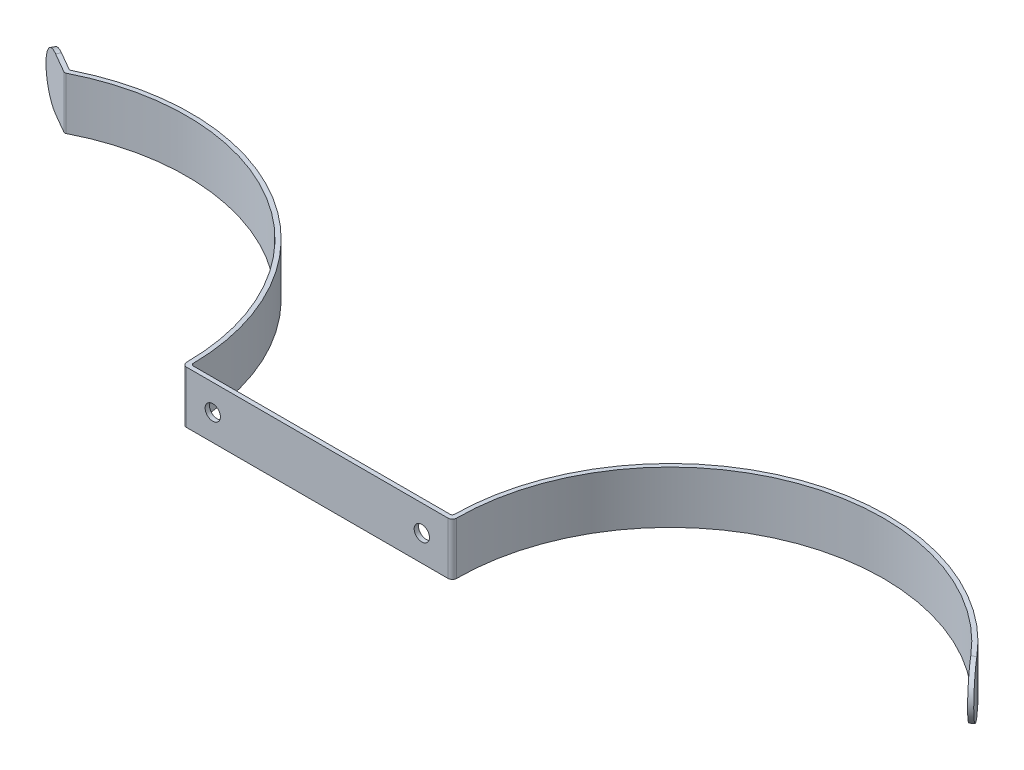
ISO-10303-21;
HEADER;
FILE_DESCRIPTION(('STEP AP214'),'2;1');
FILE_NAME('part.step','',(''),(''),'','','');
FILE_SCHEMA(('AUTOMOTIVE_DESIGN { 1 0 10303 214 1 1 1 1 }'));
ENDSEC;
DATA;
#1=APPLICATION_CONTEXT('core data for automotive mechanical design processes');
#2=APPLICATION_PROTOCOL_DEFINITION('international standard','automotive_design',2000,#1);
#3=PRODUCT_CONTEXT('',#1,'mechanical');
#4=PRODUCT('Part','Part','',(#3));
#5=PRODUCT_RELATED_PRODUCT_CATEGORY('part','',(#4));
#6=PRODUCT_DEFINITION_FORMATION('','',#4);
#7=PRODUCT_DEFINITION_CONTEXT('part definition',#1,'design');
#8=PRODUCT_DEFINITION('design','',#6,#7);
#9=PRODUCT_DEFINITION_SHAPE('','',#8);
#10=(LENGTH_UNIT() NAMED_UNIT(*) SI_UNIT(.MILLI.,.METRE.));
#11=(NAMED_UNIT(*) PLANE_ANGLE_UNIT() SI_UNIT($,.RADIAN.));
#12=(NAMED_UNIT(*) SI_UNIT($,.STERADIAN.) SOLID_ANGLE_UNIT());
#13=UNCERTAINTY_MEASURE_WITH_UNIT(LENGTH_MEASURE(1.E-05),#10,'distance_accuracy_value','');
#14=(GEOMETRIC_REPRESENTATION_CONTEXT(3) GLOBAL_UNCERTAINTY_ASSIGNED_CONTEXT((#13)) GLOBAL_UNIT_ASSIGNED_CONTEXT((#10,
#11,#12)) REPRESENTATION_CONTEXT('',''));
#15=CARTESIAN_POINT('',(0.,0.,0.));
#16=DIRECTION('',(0.,0.,1.));
#17=DIRECTION('',(1.,0.,0.));
#18=AXIS2_PLACEMENT_3D('',#15,#16,#17);
#19=CARTESIAN_POINT('',(160.,0.,0.));
#20=DIRECTION('',(0.,1.,0.));
#21=DIRECTION('',(0.,0.,1.));
#22=AXIS2_PLACEMENT_3D('',#19,#20,#21);
#23=PLANE('',#22);
#24=DIRECTION('',(0.499999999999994,0.,-0.866025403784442));
#25=VECTOR('',#24,1.);
#26=CARTESIAN_POINT('',(-49.1305826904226,0.,-8.56711770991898));
#27=LINE('',#26,#25);
#28=CARTESIAN_POINT('',(-27.363696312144,0.,-46.268470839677));
#29=VERTEX_POINT('',#28);
#30=CARTESIAN_POINT('',(-26.863696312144,0.,-47.1344962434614));
#31=VERTEX_POINT('',#30);
#32=EDGE_CURVE('E182',#29,#31,#27,.T.);
#33=ORIENTED_EDGE('',*,*,#32,.T.);
#34=DIRECTION('',(-0.866025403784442,0.,-0.499999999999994));
#35=VECTOR('',#34,1.);
#36=CARTESIAN_POINT('',(-22.766882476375,0.,-44.7691996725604));
#37=LINE('',#36,#35);
#38=CARTESIAN_POINT('',(-22.766882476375,0.,-44.7691996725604));
#39=VERTEX_POINT('',#38);
#40=EDGE_CURVE('E194',#39,#31,#37,.T.);
#41=ORIENTED_EDGE('',*,*,#40,.F.);
#42=CARTESIAN_POINT('',(-22.516882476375,0.,-45.2022123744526));
#43=DIRECTION('',(0.,-1.,0.));
#44=DIRECTION('',(0.,0.,1.));
#45=AXIS2_PLACEMENT_3D('',#42,#43,#44);
#46=CIRCLE('',#45,0.500000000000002);
#47=CARTESIAN_POINT('',(-22.2939430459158,0.,-44.7546657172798));
#48=VERTEX_POINT('',#47);
#49=EDGE_CURVE('E202',#48,#39,#46,.T.);
#50=ORIENTED_EDGE('',*,*,#49,.F.);
#51=CARTESIAN_POINT('',(0.,0.,0.));
#52=DIRECTION('',(0.,1.,0.));
#53=DIRECTION('',(0.,0.,1.));
#54=AXIS2_PLACEMENT_3D('',#51,#52,#53);
#55=CIRCLE('',#54,50.);
#56=CARTESIAN_POINT('',(49.9975491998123,0.,-0.4950495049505));
#57=VERTEX_POINT('',#56);
#58=EDGE_CURVE('E206',#57,#48,#55,.T.);
#59=ORIENTED_EDGE('',*,*,#58,.F.);
#60=CARTESIAN_POINT('',(50.4975246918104,0.,-0.5));
#61=DIRECTION('',(0.,-1.,0.));
#62=DIRECTION('',(0.,0.,-1.));
#63=AXIS2_PLACEMENT_3D('',#60,#61,#62);
#64=CIRCLE('',#63,0.499999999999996);
#65=CARTESIAN_POINT('',(50.4975246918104,0.,0.));
#66=VERTEX_POINT('',#65);
#67=EDGE_CURVE('E316',#66,#57,#64,.T.);
#68=ORIENTED_EDGE('',*,*,#67,.F.);
#69=DIRECTION('',(-1.,0.,0.));
#70=VECTOR('',#69,1.);
#71=CARTESIAN_POINT('',(50.4975246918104,0.,0.));
#72=LINE('',#71,#70);
#73=CARTESIAN_POINT('',(109.50247530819,0.,0.));
#74=VERTEX_POINT('',#73);
#75=EDGE_CURVE('E308',#74,#66,#72,.T.);
#76=ORIENTED_EDGE('',*,*,#75,.F.);
#77=CARTESIAN_POINT('',(109.50247530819,0.,-0.5));
#78=DIRECTION('',(0.,-1.,0.));
#79=DIRECTION('',(0.,0.,1.));
#80=AXIS2_PLACEMENT_3D('',#77,#78,#79);
#81=CIRCLE('',#80,0.5);
#82=CARTESIAN_POINT('',(110.002450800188,0.,-0.495049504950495));
#83=VERTEX_POINT('',#82);
#84=EDGE_CURVE('E305',#83,#74,#81,.T.);
#85=ORIENTED_EDGE('',*,*,#84,.F.);
#86=CARTESIAN_POINT('',(160.,0.,0.));
#87=DIRECTION('',(0.,1.,0.));
#88=DIRECTION('',(0.,0.,1.));
#89=AXIS2_PLACEMENT_3D('',#86,#87,#88);
#90=CIRCLE('',#89,50.);
#91=CARTESIAN_POINT('',(198.235923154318,0.,-32.2182274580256));
#92=VERTEX_POINT('',#91);
#93=EDGE_CURVE('E302',#92,#83,#90,.T.);
#94=ORIENTED_EDGE('',*,*,#93,.F.);
#95=DIRECTION('',(0.764718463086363,0.,-0.644364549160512));
#96=VECTOR('',#95,1.);
#97=CARTESIAN_POINT('',(46.8993352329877,0.,95.3005091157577));
#98=LINE('',#97,#96);
#99=CARTESIAN_POINT('',(197.471204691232,0.,-31.5738629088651));
#100=VERTEX_POINT('',#99);
#101=EDGE_CURVE('E74',#100,#92,#98,.T.);
#102=ORIENTED_EDGE('',*,*,#101,.F.);
#103=CARTESIAN_POINT('',(160.,0.,0.));
#104=DIRECTION('',(0.,-1.,0.));
#105=DIRECTION('',(0.,0.,1.));
#106=AXIS2_PLACEMENT_3D('',#103,#104,#105);
#107=CIRCLE('',#106,49.);
#108=CARTESIAN_POINT('',(111.,0.,0.));
#109=VERTEX_POINT('',#108);
#110=EDGE_CURVE('E219',#109,#100,#107,.T.);
#111=ORIENTED_EDGE('',*,*,#110,.F.);
#112=CARTESIAN_POINT('',(110.,0.,0.));
#113=DIRECTION('',(0.,1.,0.));
#114=DIRECTION('',(0.,0.,1.));
#115=AXIS2_PLACEMENT_3D('',#112,#113,#114);
#116=CIRCLE('',#115,0.999999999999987);
#117=CARTESIAN_POINT('',(110.,0.,0.999999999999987));
#118=VERTEX_POINT('',#117);
#119=EDGE_CURVE('E217',#118,#109,#116,.T.);
#120=ORIENTED_EDGE('',*,*,#119,.F.);
#121=DIRECTION('',(1.,0.,0.));
#122=VECTOR('',#121,1.);
#123=CARTESIAN_POINT('',(50.,0.,1.));
#124=LINE('',#123,#122);
#125=CARTESIAN_POINT('',(50.,0.,1.));
#126=VERTEX_POINT('',#125);
#127=EDGE_CURVE('E215',#126,#118,#124,.T.);
#128=ORIENTED_EDGE('',*,*,#127,.F.);
#129=CARTESIAN_POINT('',(50.,0.,0.));
#130=DIRECTION('',(0.,1.,0.));
#131=DIRECTION('',(0.,0.,1.));
#132=AXIS2_PLACEMENT_3D('',#129,#130,#131);
#133=CIRCLE('',#132,1.);
#134=CARTESIAN_POINT('',(49.,0.,0.));
#135=VERTEX_POINT('',#134);
#136=EDGE_CURVE('E213',#135,#126,#133,.T.);
#137=ORIENTED_EDGE('',*,*,#136,.F.);
#138=CARTESIAN_POINT('',(0.,0.,0.));
#139=DIRECTION('',(0.,-1.,0.));
#140=DIRECTION('',(0.,0.,1.));
#141=AXIS2_PLACEMENT_3D('',#138,#139,#140);
#142=CIRCLE('',#141,49.);
#143=CARTESIAN_POINT('',(-22.3209786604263,0.,-43.6207967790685));
#144=VERTEX_POINT('',#143);
#145=EDGE_CURVE('E211',#144,#135,#142,.T.);
#146=ORIENTED_EDGE('',*,*,#145,.F.);
#147=CARTESIAN_POINT('',(-22.548743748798,0.,-44.0659069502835));
#148=DIRECTION('',(0.,1.,0.));
#149=DIRECTION('',(0.,0.,1.));
#150=AXIS2_PLACEMENT_3D('',#147,#148,#149);
#151=CIRCLE('',#150,0.500000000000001);
#152=CARTESIAN_POINT('',(-22.798743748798,0.,-43.6328942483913));
#153=VERTEX_POINT('',#152);
#154=EDGE_CURVE('E204',#153,#144,#151,.T.);
#155=ORIENTED_EDGE('',*,*,#154,.F.);
#156=DIRECTION('',(0.866025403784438,0.,0.500000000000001));
#157=VECTOR('',#156,1.);
#158=CARTESIAN_POINT('',(-32.5598487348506,0.,-49.268470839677));
#159=LINE('',#158,#157);
#160=EDGE_CURVE('E196',#29,#153,#159,.T.);
#161=ORIENTED_EDGE('',*,*,#160,.F.);
#162=EDGE_LOOP('',(#33,#41,#50,#59,#68,#76,#85,#94,#102,#111,#120,#128,#137,#146,#155,#161));
#163=FACE_BOUND('',#162,.T.);
#164=ADVANCED_FACE('F66',(#163),#23,.F.);
#165=CARTESIAN_POINT('',(160.,12.,0.));
#166=DIRECTION('',(0.,1.,0.));
#167=DIRECTION('',(0.,0.,1.));
#168=AXIS2_PLACEMENT_3D('',#165,#166,#167);
#169=PLANE('',#168);
#170=DIRECTION('',(-0.866025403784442,0.,-0.499999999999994));
#171=VECTOR('',#170,1.);
#172=CARTESIAN_POINT('',(-22.766882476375,12.,-44.7691996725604));
#173=LINE('',#172,#171);
#174=CARTESIAN_POINT('',(-22.766882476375,12.,-44.7691996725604));
#175=VERTEX_POINT('',#174);
#176=CARTESIAN_POINT('',(-26.863696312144,12.,-47.1344962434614));
#177=VERTEX_POINT('',#176);
#178=EDGE_CURVE('E235',#175,#177,#173,.T.);
#179=ORIENTED_EDGE('',*,*,#178,.T.);
#180=DIRECTION('',(0.499999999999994,0.,-0.866025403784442));
#181=VECTOR('',#180,1.);
#182=CARTESIAN_POINT('',(-49.1305826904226,12.,-8.56711770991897));
#183=LINE('',#182,#181);
#184=CARTESIAN_POINT('',(-27.363696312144,12.,-46.268470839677));
#185=VERTEX_POINT('',#184);
#186=EDGE_CURVE('E185',#185,#177,#183,.T.);
#187=ORIENTED_EDGE('',*,*,#186,.F.);
#188=DIRECTION('',(0.866025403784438,0.,0.500000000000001));
#189=VECTOR('',#188,1.);
#190=CARTESIAN_POINT('',(-32.5598487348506,12.,-49.268470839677));
#191=LINE('',#190,#189);
#192=CARTESIAN_POINT('',(-22.798743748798,12.,-43.6328942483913));
#193=VERTEX_POINT('',#192);
#194=EDGE_CURVE('E237',#185,#193,#191,.T.);
#195=ORIENTED_EDGE('',*,*,#194,.T.);
#196=CARTESIAN_POINT('',(-22.548743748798,12.,-44.0659069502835));
#197=DIRECTION('',(0.,1.,0.));
#198=DIRECTION('',(0.,0.,1.));
#199=AXIS2_PLACEMENT_3D('',#196,#197,#198);
#200=CIRCLE('',#199,0.500000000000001);
#201=CARTESIAN_POINT('',(-22.3209786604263,12.,-43.6207967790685));
#202=VERTEX_POINT('',#201);
#203=EDGE_CURVE('E239',#193,#202,#200,.T.);
#204=ORIENTED_EDGE('',*,*,#203,.T.);
#205=CARTESIAN_POINT('',(0.,12.,0.));
#206=DIRECTION('',(0.,-1.,0.));
#207=DIRECTION('',(0.,0.,1.));
#208=AXIS2_PLACEMENT_3D('',#205,#206,#207);
#209=CIRCLE('',#208,49.);
#210=CARTESIAN_POINT('',(49.,12.,0.));
#211=VERTEX_POINT('',#210);
#212=EDGE_CURVE('E241',#202,#211,#209,.T.);
#213=ORIENTED_EDGE('',*,*,#212,.T.);
#214=CARTESIAN_POINT('',(50.,12.,0.));
#215=DIRECTION('',(0.,1.,0.));
#216=DIRECTION('',(0.,0.,1.));
#217=AXIS2_PLACEMENT_3D('',#214,#215,#216);
#218=CIRCLE('',#217,1.);
#219=CARTESIAN_POINT('',(50.,12.,1.));
#220=VERTEX_POINT('',#219);
#221=EDGE_CURVE('E243',#211,#220,#218,.T.);
#222=ORIENTED_EDGE('',*,*,#221,.T.);
#223=DIRECTION('',(1.,0.,0.));
#224=VECTOR('',#223,1.);
#225=CARTESIAN_POINT('',(50.,12.,1.));
#226=LINE('',#225,#224);
#227=CARTESIAN_POINT('',(110.,12.,0.999999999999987));
#228=VERTEX_POINT('',#227);
#229=EDGE_CURVE('E245',#220,#228,#226,.T.);
#230=ORIENTED_EDGE('',*,*,#229,.T.);
#231=CARTESIAN_POINT('',(110.,12.,0.));
#232=DIRECTION('',(0.,1.,0.));
#233=DIRECTION('',(0.,0.,1.));
#234=AXIS2_PLACEMENT_3D('',#231,#232,#233);
#235=CIRCLE('',#234,0.999999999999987);
#236=CARTESIAN_POINT('',(111.,12.,0.));
#237=VERTEX_POINT('',#236);
#238=EDGE_CURVE('E89',#228,#237,#235,.T.);
#239=ORIENTED_EDGE('',*,*,#238,.T.);
#240=CARTESIAN_POINT('',(160.,12.,0.));
#241=DIRECTION('',(0.,-1.,0.));
#242=DIRECTION('',(0.,0.,1.));
#243=AXIS2_PLACEMENT_3D('',#240,#241,#242);
#244=CIRCLE('',#243,49.);
#245=CARTESIAN_POINT('',(197.471204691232,12.,-31.5738629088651));
#246=VERTEX_POINT('',#245);
#247=EDGE_CURVE('E248',#237,#246,#244,.T.);
#248=ORIENTED_EDGE('',*,*,#247,.T.);
#249=DIRECTION('',(0.764718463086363,0.,-0.644364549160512));
#250=VECTOR('',#249,1.);
#251=CARTESIAN_POINT('',(46.8993352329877,12.,95.3005091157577));
#252=LINE('',#251,#250);
#253=CARTESIAN_POINT('',(198.235923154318,12.,-32.2182274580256));
#254=VERTEX_POINT('',#253);
#255=EDGE_CURVE('E290',#246,#254,#252,.T.);
#256=ORIENTED_EDGE('',*,*,#255,.T.);
#257=CARTESIAN_POINT('',(160.,12.,0.));
#258=DIRECTION('',(0.,1.,0.));
#259=DIRECTION('',(0.,0.,1.));
#260=AXIS2_PLACEMENT_3D('',#257,#258,#259);
#261=CIRCLE('',#260,50.);
#262=CARTESIAN_POINT('',(110.002450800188,12.,-0.495049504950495));
#263=VERTEX_POINT('',#262);
#264=EDGE_CURVE('E222',#254,#263,#261,.T.);
#265=ORIENTED_EDGE('',*,*,#264,.T.);
#266=CARTESIAN_POINT('',(109.50247530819,12.,-0.5));
#267=DIRECTION('',(0.,-1.,0.));
#268=DIRECTION('',(0.,0.,1.));
#269=AXIS2_PLACEMENT_3D('',#266,#267,#268);
#270=CIRCLE('',#269,0.5);
#271=CARTESIAN_POINT('',(109.50247530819,12.,0.));
#272=VERTEX_POINT('',#271);
#273=EDGE_CURVE('E225',#263,#272,#270,.T.);
#274=ORIENTED_EDGE('',*,*,#273,.T.);
#275=DIRECTION('',(-1.,0.,0.));
#276=VECTOR('',#275,1.);
#277=CARTESIAN_POINT('',(50.4975246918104,12.,0.));
#278=LINE('',#277,#276);
#279=CARTESIAN_POINT('',(50.4975246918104,12.,0.));
#280=VERTEX_POINT('',#279);
#281=EDGE_CURVE('E227',#272,#280,#278,.T.);
#282=ORIENTED_EDGE('',*,*,#281,.T.);
#283=CARTESIAN_POINT('',(50.4975246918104,12.,-0.5));
#284=DIRECTION('',(0.,-1.,0.));
#285=DIRECTION('',(0.,0.,-1.));
#286=AXIS2_PLACEMENT_3D('',#283,#284,#285);
#287=CIRCLE('',#286,0.499999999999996);
#288=CARTESIAN_POINT('',(49.9975491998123,12.,-0.4950495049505));
#289=VERTEX_POINT('',#288);
#290=EDGE_CURVE('E229',#280,#289,#287,.T.);
#291=ORIENTED_EDGE('',*,*,#290,.T.);
#292=CARTESIAN_POINT('',(0.,12.,0.));
#293=DIRECTION('',(0.,1.,0.));
#294=DIRECTION('',(0.,0.,1.));
#295=AXIS2_PLACEMENT_3D('',#292,#293,#294);
#296=CIRCLE('',#295,50.);
#297=CARTESIAN_POINT('',(-22.2939430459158,12.,-44.7546657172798));
#298=VERTEX_POINT('',#297);
#299=EDGE_CURVE('E231',#289,#298,#296,.T.);
#300=ORIENTED_EDGE('',*,*,#299,.T.);
#301=CARTESIAN_POINT('',(-22.516882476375,12.,-45.2022123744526));
#302=DIRECTION('',(0.,-1.,0.));
#303=DIRECTION('',(0.,0.,1.));
#304=AXIS2_PLACEMENT_3D('',#301,#302,#303);
#305=CIRCLE('',#304,0.500000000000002);
#306=EDGE_CURVE('E233',#298,#175,#305,.T.);
#307=ORIENTED_EDGE('',*,*,#306,.T.);
#308=EDGE_LOOP('',(#179,#187,#195,#204,#213,#222,#230,#239,#248,#256,#265,#274,#282,#291,#300,#307));
#309=FACE_BOUND('',#308,.T.);
#310=ADVANCED_FACE('F327',(#309),#169,.T.);
#311=CARTESIAN_POINT('',(197.471204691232,12.,-31.5738629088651));
#312=DIRECTION('',(0.764718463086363,0.,-0.644364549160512));
#313=DIRECTION('',(-0.644364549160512,0.,-0.764718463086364));
#314=AXIS2_PLACEMENT_3D('',#311,#312,#313);
#315=PLANE('',#314);
#316=DIRECTION('',(0.,-1.,0.));
#317=VECTOR('',#316,1.);
#318=CARTESIAN_POINT('',(197.471204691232,12.,-31.5738629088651));
#319=LINE('',#318,#317);
#320=EDGE_CURVE('E253',#246,#100,#319,.T.);
#321=ORIENTED_EDGE('',*,*,#320,.T.);
#322=CARTESIAN_POINT('',(197.471204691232,6.,-31.5738629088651));
#323=DIRECTION('',(0.764718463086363,0.,-0.644364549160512));
#324=DIRECTION('',(-0.644364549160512,0.,-0.764718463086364));
#325=AXIS2_PLACEMENT_3D('',#322,#323,#324);
#326=CIRCLE('',#325,6.);
#327=EDGE_CURVE('E294',#246,#100,#326,.T.);
#328=ORIENTED_EDGE('',*,*,#327,.F.);
#329=EDGE_LOOP('',(#321,#328));
#330=FACE_BOUND('',#329,.T.);
#331=ADVANCED_FACE('F341',(#330),#315,.F.);
#332=CARTESIAN_POINT('',(198.235923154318,12.,-32.2182274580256));
#333=DIRECTION('',(-0.764718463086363,0.,0.644364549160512));
#334=DIRECTION('',(0.644364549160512,0.,0.764718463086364));
#335=AXIS2_PLACEMENT_3D('',#332,#333,#334);
#336=PLANE('',#335);
#337=CARTESIAN_POINT('',(198.235923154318,6.,-32.2182274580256));
#338=DIRECTION('',(0.764718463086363,0.,-0.644364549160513));
#339=DIRECTION('',(-0.644364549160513,0.,-0.764718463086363));
#340=AXIS2_PLACEMENT_3D('',#337,#338,#339);
#341=CIRCLE('',#340,6.);
#342=EDGE_CURVE('E81',#254,#92,#341,.T.);
#343=ORIENTED_EDGE('',*,*,#342,.T.);
#344=DIRECTION('',(0.,-1.,0.));
#345=VECTOR('',#344,1.);
#346=CARTESIAN_POINT('',(198.235923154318,12.,-32.2182274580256));
#347=LINE('',#346,#345);
#348=EDGE_CURVE('E250',#254,#92,#347,.T.);
#349=ORIENTED_EDGE('',*,*,#348,.F.);
#350=EDGE_LOOP('',(#343,#349));
#351=FACE_BOUND('',#350,.T.);
#352=ADVANCED_FACE('F374',(#351),#336,.F.);
#353=CARTESIAN_POINT('',(160.,12.,0.));
#354=DIRECTION('',(0.,-1.,0.));
#355=DIRECTION('',(0.,0.,-1.));
#356=AXIS2_PLACEMENT_3D('',#353,#354,#355);
#357=CYLINDRICAL_SURFACE('',#356,50.);
#358=ORIENTED_EDGE('',*,*,#93,.T.);
#359=DIRECTION('',(0.,-1.,0.));
#360=VECTOR('',#359,1.);
#361=CARTESIAN_POINT('',(110.002450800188,12.,-0.495049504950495));
#362=LINE('',#361,#360);
#363=EDGE_CURVE('E287',#263,#83,#362,.T.);
#364=ORIENTED_EDGE('',*,*,#363,.F.);
#365=ORIENTED_EDGE('',*,*,#264,.F.);
#366=ORIENTED_EDGE('',*,*,#348,.T.);
#367=EDGE_LOOP('',(#358,#364,#365,#366));
#368=FACE_BOUND('',#367,.T.);
#369=ADVANCED_FACE('F68',(#368),#357,.T.);
#370=CARTESIAN_POINT('',(109.50247530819,12.,-0.5));
#371=DIRECTION('',(0.,-1.,0.));
#372=DIRECTION('',(0.,0.,-1.));
#373=AXIS2_PLACEMENT_3D('',#370,#371,#372);
#374=CYLINDRICAL_SURFACE('',#373,0.5);
#375=ORIENTED_EDGE('',*,*,#84,.T.);
#376=DIRECTION('',(0.,-1.,0.));
#377=VECTOR('',#376,1.);
#378=CARTESIAN_POINT('',(109.50247530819,12.,0.));
#379=LINE('',#378,#377);
#380=EDGE_CURVE('E284',#272,#74,#379,.T.);
#381=ORIENTED_EDGE('',*,*,#380,.F.);
#382=ORIENTED_EDGE('',*,*,#273,.F.);
#383=ORIENTED_EDGE('',*,*,#363,.T.);
#384=EDGE_LOOP('',(#375,#381,#382,#383));
#385=FACE_BOUND('',#384,.T.);
#386=ADVANCED_FACE('F337',(#385),#374,.F.);
#387=CARTESIAN_POINT('',(50.4975246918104,12.,0.));
#388=DIRECTION('',(0.,0.,1.));
#389=DIRECTION('',(1.,0.,0.));
#390=AXIS2_PLACEMENT_3D('',#387,#388,#389);
#391=PLANE('',#390);
#392=CARTESIAN_POINT('',(104.,6.,0.));
#393=DIRECTION('',(0.,0.,-1.));
#394=DIRECTION('',(-1.,0.,0.));
#395=AXIS2_PLACEMENT_3D('',#392,#393,#394);
#396=CIRCLE('',#395,1.75);
#397=CARTESIAN_POINT('',(102.25,6.,0.));
#398=VERTEX_POINT('',#397);
#399=EDGE_CURVE('E342',#398,#398,#396,.T.);
#400=ORIENTED_EDGE('',*,*,#399,.F.);
#401=EDGE_LOOP('',(#400));
#402=FACE_BOUND('',#401,.T.);
#403=CARTESIAN_POINT('',(56.,6.,0.));
#404=DIRECTION('',(0.,0.,-1.));
#405=DIRECTION('',(-1.,0.,0.));
#406=AXIS2_PLACEMENT_3D('',#403,#404,#405);
#407=CIRCLE('',#406,1.75);
#408=CARTESIAN_POINT('',(54.25,6.,0.));
#409=VERTEX_POINT('',#408);
#410=EDGE_CURVE('E311',#409,#409,#407,.T.);
#411=ORIENTED_EDGE('',*,*,#410,.F.);
#412=EDGE_LOOP('',(#411));
#413=FACE_BOUND('',#412,.T.);
#414=ORIENTED_EDGE('',*,*,#75,.T.);
#415=DIRECTION('',(0.,-1.,0.));
#416=VECTOR('',#415,1.);
#417=CARTESIAN_POINT('',(50.4975246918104,12.,0.));
#418=LINE('',#417,#416);
#419=EDGE_CURVE('E281',#280,#66,#418,.T.);
#420=ORIENTED_EDGE('',*,*,#419,.F.);
#421=ORIENTED_EDGE('',*,*,#281,.F.);
#422=ORIENTED_EDGE('',*,*,#380,.T.);
#423=EDGE_LOOP('',(#414,#420,#421,#422));
#424=FACE_BOUND('',#423,.T.);
#425=ADVANCED_FACE('F334',(#402,#413,#424),#391,.F.);
#426=CARTESIAN_POINT('',(50.4975246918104,12.,-0.5));
#427=DIRECTION('',(0.,-1.,0.));
#428=DIRECTION('',(0.,0.,-1.));
#429=AXIS2_PLACEMENT_3D('',#426,#427,#428);
#430=CYLINDRICAL_SURFACE('',#429,0.499999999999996);
#431=ORIENTED_EDGE('',*,*,#67,.T.);
#432=DIRECTION('',(0.,-1.,0.));
#433=VECTOR('',#432,1.);
#434=CARTESIAN_POINT('',(49.9975491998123,12.,-0.4950495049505));
#435=LINE('',#434,#433);
#436=EDGE_CURVE('E278',#289,#57,#435,.T.);
#437=ORIENTED_EDGE('',*,*,#436,.F.);
#438=ORIENTED_EDGE('',*,*,#290,.F.);
#439=ORIENTED_EDGE('',*,*,#419,.T.);
#440=EDGE_LOOP('',(#431,#437,#438,#439));
#441=FACE_BOUND('',#440,.T.);
#442=ADVANCED_FACE('F332',(#441),#430,.F.);
#443=CARTESIAN_POINT('',(0.,12.,0.));
#444=DIRECTION('',(0.,-1.,0.));
#445=DIRECTION('',(0.,0.,-1.));
#446=AXIS2_PLACEMENT_3D('',#443,#444,#445);
#447=CYLINDRICAL_SURFACE('',#446,50.);
#448=ORIENTED_EDGE('',*,*,#58,.T.);
#449=DIRECTION('',(0.,-1.,0.));
#450=VECTOR('',#449,1.);
#451=CARTESIAN_POINT('',(-22.2939430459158,12.,-44.7546657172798));
#452=LINE('',#451,#450);
#453=EDGE_CURVE('E275',#298,#48,#452,.T.);
#454=ORIENTED_EDGE('',*,*,#453,.F.);
#455=ORIENTED_EDGE('',*,*,#299,.F.);
#456=ORIENTED_EDGE('',*,*,#436,.T.);
#457=EDGE_LOOP('',(#448,#454,#455,#456));
#458=FACE_BOUND('',#457,.T.);
#459=ADVANCED_FACE('F320',(#458),#447,.T.);
#460=CARTESIAN_POINT('',(-22.516882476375,12.,-45.2022123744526));
#461=DIRECTION('',(0.,-1.,0.));
#462=DIRECTION('',(0.,0.,-1.));
#463=AXIS2_PLACEMENT_3D('',#460,#461,#462);
#464=CYLINDRICAL_SURFACE('',#463,0.500000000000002);
#465=ORIENTED_EDGE('',*,*,#49,.T.);
#466=DIRECTION('',(0.,-1.,0.));
#467=VECTOR('',#466,1.);
#468=CARTESIAN_POINT('',(-22.766882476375,12.,-44.7691996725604));
#469=LINE('',#468,#467);
#470=EDGE_CURVE('E201',#175,#39,#469,.T.);
#471=ORIENTED_EDGE('',*,*,#470,.F.);
#472=ORIENTED_EDGE('',*,*,#306,.F.);
#473=ORIENTED_EDGE('',*,*,#453,.T.);
#474=EDGE_LOOP('',(#465,#471,#472,#473));
#475=FACE_BOUND('',#474,.T.);
#476=ADVANCED_FACE('F326',(#475),#464,.F.);
#477=CARTESIAN_POINT('',(-22.766882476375,12.,-44.7691996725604));
#478=DIRECTION('',(-0.499999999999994,0.,0.866025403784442));
#479=DIRECTION('',(0.866025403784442,0.,0.499999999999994));
#480=AXIS2_PLACEMENT_3D('',#477,#478,#479);
#481=PLANE('',#480);
#482=ORIENTED_EDGE('',*,*,#40,.T.);
#483=CARTESIAN_POINT('',(-26.863696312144,6.,-47.1344962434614));
#484=DIRECTION('',(-0.499999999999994,0.,0.866025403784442));
#485=DIRECTION('',(0.866025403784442,0.,0.499999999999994));
#486=AXIS2_PLACEMENT_3D('',#483,#484,#485);
#487=CIRCLE('',#486,6.);
#488=EDGE_CURVE('E179',#177,#31,#487,.T.);
#489=ORIENTED_EDGE('',*,*,#488,.F.);
#490=ORIENTED_EDGE('',*,*,#178,.F.);
#491=ORIENTED_EDGE('',*,*,#470,.T.);
#492=EDGE_LOOP('',(#482,#489,#490,#491));
#493=FACE_BOUND('',#492,.T.);
#494=ADVANCED_FACE('F199',(#493),#481,.F.);
#495=CARTESIAN_POINT('',(-32.5598487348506,12.,-49.268470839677));
#496=DIRECTION('',(0.500000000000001,0.,-0.866025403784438));
#497=DIRECTION('',(-0.866025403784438,0.,-0.500000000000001));
#498=AXIS2_PLACEMENT_3D('',#495,#496,#497);
#499=PLANE('',#498);
#500=CARTESIAN_POINT('',(-27.363696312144,6.,-46.268470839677));
#501=DIRECTION('',(0.500000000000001,0.,-0.866025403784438));
#502=DIRECTION('',(-0.866025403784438,0.,-0.500000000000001));
#503=AXIS2_PLACEMENT_3D('',#500,#501,#502);
#504=CIRCLE('',#503,6.);
#505=EDGE_CURVE('E12',#185,#29,#504,.F.);
#506=ORIENTED_EDGE('',*,*,#505,.T.);
#507=ORIENTED_EDGE('',*,*,#160,.T.);
#508=DIRECTION('',(0.,-1.,0.));
#509=VECTOR('',#508,1.);
#510=CARTESIAN_POINT('',(-22.798743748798,12.,-43.6328942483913));
#511=LINE('',#510,#509);
#512=EDGE_CURVE('E271',#193,#153,#511,.T.);
#513=ORIENTED_EDGE('',*,*,#512,.F.);
#514=ORIENTED_EDGE('',*,*,#194,.F.);
#515=EDGE_LOOP('',(#506,#507,#513,#514));
#516=FACE_BOUND('',#515,.T.);
#517=ADVANCED_FACE('F402',(#516),#499,.F.);
#518=CARTESIAN_POINT('',(-22.548743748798,12.,-44.0659069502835));
#519=DIRECTION('',(0.,-1.,0.));
#520=DIRECTION('',(0.,0.,-1.));
#521=AXIS2_PLACEMENT_3D('',#518,#519,#520);
#522=CYLINDRICAL_SURFACE('',#521,0.500000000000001);
#523=ORIENTED_EDGE('',*,*,#154,.T.);
#524=DIRECTION('',(0.,-1.,0.));
#525=VECTOR('',#524,1.);
#526=CARTESIAN_POINT('',(-22.3209786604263,12.,-43.6207967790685));
#527=LINE('',#526,#525);
#528=EDGE_CURVE('E268',#202,#144,#527,.T.);
#529=ORIENTED_EDGE('',*,*,#528,.F.);
#530=ORIENTED_EDGE('',*,*,#203,.F.);
#531=ORIENTED_EDGE('',*,*,#512,.T.);
#532=EDGE_LOOP('',(#523,#529,#530,#531));
#533=FACE_BOUND('',#532,.T.);
#534=ADVANCED_FACE('F398',(#533),#522,.T.);
#535=CARTESIAN_POINT('',(0.,12.,0.));
#536=DIRECTION('',(0.,-1.,0.));
#537=DIRECTION('',(0.,0.,-1.));
#538=AXIS2_PLACEMENT_3D('',#535,#536,#537);
#539=CYLINDRICAL_SURFACE('',#538,49.);
#540=ORIENTED_EDGE('',*,*,#145,.T.);
#541=DIRECTION('',(0.,-1.,0.));
#542=VECTOR('',#541,1.);
#543=CARTESIAN_POINT('',(49.,12.,0.));
#544=LINE('',#543,#542);
#545=EDGE_CURVE('E265',#211,#135,#544,.T.);
#546=ORIENTED_EDGE('',*,*,#545,.F.);
#547=ORIENTED_EDGE('',*,*,#212,.F.);
#548=ORIENTED_EDGE('',*,*,#528,.T.);
#549=EDGE_LOOP('',(#540,#546,#547,#548));
#550=FACE_BOUND('',#549,.T.);
#551=ADVANCED_FACE('F394',(#550),#539,.F.);
#552=CARTESIAN_POINT('',(50.,12.,0.));
#553=DIRECTION('',(0.,-1.,0.));
#554=DIRECTION('',(0.,0.,-1.));
#555=AXIS2_PLACEMENT_3D('',#552,#553,#554);
#556=CYLINDRICAL_SURFACE('',#555,1.);
#557=ORIENTED_EDGE('',*,*,#136,.T.);
#558=DIRECTION('',(0.,-1.,0.));
#559=VECTOR('',#558,1.);
#560=CARTESIAN_POINT('',(50.,12.,1.));
#561=LINE('',#560,#559);
#562=EDGE_CURVE('E262',#220,#126,#561,.T.);
#563=ORIENTED_EDGE('',*,*,#562,.F.);
#564=ORIENTED_EDGE('',*,*,#221,.F.);
#565=ORIENTED_EDGE('',*,*,#545,.T.);
#566=EDGE_LOOP('',(#557,#563,#564,#565));
#567=FACE_BOUND('',#566,.T.);
#568=ADVANCED_FACE('F390',(#567),#556,.T.);
#569=CARTESIAN_POINT('',(50.,12.,1.));
#570=DIRECTION('',(0.,0.,-1.));
#571=DIRECTION('',(-1.,0.,0.));
#572=AXIS2_PLACEMENT_3D('',#569,#570,#571);
#573=PLANE('',#572);
#574=CARTESIAN_POINT('',(104.,6.,1.));
#575=DIRECTION('',(0.,0.,-1.));
#576=DIRECTION('',(-1.,0.,0.));
#577=AXIS2_PLACEMENT_3D('',#574,#575,#576);
#578=CIRCLE('',#577,1.75);
#579=CARTESIAN_POINT('',(102.25,6.,1.));
#580=VERTEX_POINT('',#579);
#581=EDGE_CURVE('E345',#580,#580,#578,.T.);
#582=ORIENTED_EDGE('',*,*,#581,.T.);
#583=EDGE_LOOP('',(#582));
#584=FACE_BOUND('',#583,.T.);
#585=CARTESIAN_POINT('',(56.,6.,1.));
#586=DIRECTION('',(0.,0.,-1.));
#587=DIRECTION('',(-1.,0.,0.));
#588=AXIS2_PLACEMENT_3D('',#585,#586,#587);
#589=CIRCLE('',#588,1.75);
#590=CARTESIAN_POINT('',(54.25,6.,1.));
#591=VERTEX_POINT('',#590);
#592=EDGE_CURVE('E306',#591,#591,#589,.T.);
#593=ORIENTED_EDGE('',*,*,#592,.T.);
#594=EDGE_LOOP('',(#593));
#595=FACE_BOUND('',#594,.T.);
#596=ORIENTED_EDGE('',*,*,#127,.T.);
#597=DIRECTION('',(0.,-1.,0.));
#598=VECTOR('',#597,1.);
#599=CARTESIAN_POINT('',(110.,12.,0.999999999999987));
#600=LINE('',#599,#598);
#601=EDGE_CURVE('E259',#228,#118,#600,.T.);
#602=ORIENTED_EDGE('',*,*,#601,.F.);
#603=ORIENTED_EDGE('',*,*,#229,.F.);
#604=ORIENTED_EDGE('',*,*,#562,.T.);
#605=EDGE_LOOP('',(#596,#602,#603,#604));
#606=FACE_BOUND('',#605,.T.);
#607=ADVANCED_FACE('F386',(#584,#595,#606),#573,.F.);
#608=CARTESIAN_POINT('',(110.,12.,0.));
#609=DIRECTION('',(0.,-1.,0.));
#610=DIRECTION('',(0.,0.,-1.));
#611=AXIS2_PLACEMENT_3D('',#608,#609,#610);
#612=CYLINDRICAL_SURFACE('',#611,0.999999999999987);
#613=ORIENTED_EDGE('',*,*,#119,.T.);
#614=DIRECTION('',(0.,-1.,0.));
#615=VECTOR('',#614,1.);
#616=CARTESIAN_POINT('',(111.,12.,0.));
#617=LINE('',#616,#615);
#618=EDGE_CURVE('E256',#237,#109,#617,.T.);
#619=ORIENTED_EDGE('',*,*,#618,.F.);
#620=ORIENTED_EDGE('',*,*,#238,.F.);
#621=ORIENTED_EDGE('',*,*,#601,.T.);
#622=EDGE_LOOP('',(#613,#619,#620,#621));
#623=FACE_BOUND('',#622,.T.);
#624=ADVANCED_FACE('F382',(#623),#612,.T.);
#625=CARTESIAN_POINT('',(160.,12.,0.));
#626=DIRECTION('',(0.,-1.,0.));
#627=DIRECTION('',(0.,0.,-1.));
#628=AXIS2_PLACEMENT_3D('',#625,#626,#627);
#629=CYLINDRICAL_SURFACE('',#628,49.);
#630=ORIENTED_EDGE('',*,*,#110,.T.);
#631=ORIENTED_EDGE('',*,*,#320,.F.);
#632=ORIENTED_EDGE('',*,*,#247,.F.);
#633=ORIENTED_EDGE('',*,*,#618,.T.);
#634=EDGE_LOOP('',(#630,#631,#632,#633));
#635=FACE_BOUND('',#634,.T.);
#636=ADVANCED_FACE('F379',(#635),#629,.F.);
#637=CARTESIAN_POINT('',(56.,6.,1.));
#638=DIRECTION('',(0.,0.,-1.));
#639=DIRECTION('',(-1.,0.,0.));
#640=AXIS2_PLACEMENT_3D('',#637,#638,#639);
#641=CYLINDRICAL_SURFACE('',#640,1.75);
#642=ORIENTED_EDGE('',*,*,#592,.F.);
#643=EDGE_LOOP('',(#642));
#644=FACE_BOUND('',#643,.T.);
#645=ORIENTED_EDGE('',*,*,#410,.T.);
#646=EDGE_LOOP('',(#645));
#647=FACE_BOUND('',#646,.T.);
#648=ADVANCED_FACE('F354',(#644,#647),#641,.F.);
#649=CARTESIAN_POINT('',(104.,6.,1.));
#650=DIRECTION('',(0.,0.,-1.));
#651=DIRECTION('',(-1.,0.,0.));
#652=AXIS2_PLACEMENT_3D('',#649,#650,#651);
#653=CYLINDRICAL_SURFACE('',#652,1.75);
#654=ORIENTED_EDGE('',*,*,#581,.F.);
#655=EDGE_LOOP('',(#654));
#656=FACE_BOUND('',#655,.T.);
#657=ORIENTED_EDGE('',*,*,#399,.T.);
#658=EDGE_LOOP('',(#657));
#659=FACE_BOUND('',#658,.T.);
#660=ADVANCED_FACE('F462',(#656,#659),#653,.F.);
#661=CARTESIAN_POINT('',(46.8993352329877,6.,95.3005091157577));
#662=DIRECTION('',(0.764718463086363,0.,-0.644364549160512));
#663=DIRECTION('',(-0.644364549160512,0.,-0.764718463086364));
#664=AXIS2_PLACEMENT_3D('',#661,#662,#663);
#665=CYLINDRICAL_SURFACE('',#664,6.);
#666=ORIENTED_EDGE('',*,*,#327,.T.);
#667=ORIENTED_EDGE('',*,*,#101,.T.);
#668=ORIENTED_EDGE('',*,*,#342,.F.);
#669=ORIENTED_EDGE('',*,*,#255,.F.);
#670=EDGE_LOOP('',(#666,#667,#668,#669));
#671=FACE_BOUND('',#670,.T.);
#672=ADVANCED_FACE('F292',(#671),#665,.T.);
#673=CARTESIAN_POINT('',(-49.1305826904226,6.,-8.56711770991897));
#674=DIRECTION('',(0.499999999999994,0.,-0.866025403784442));
#675=DIRECTION('',(-0.866025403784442,0.,-0.499999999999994));
#676=AXIS2_PLACEMENT_3D('',#673,#674,#675);
#677=CYLINDRICAL_SURFACE('',#676,6.);
#678=ORIENTED_EDGE('',*,*,#186,.T.);
#679=ORIENTED_EDGE('',*,*,#488,.T.);
#680=ORIENTED_EDGE('',*,*,#32,.F.);
#681=ORIENTED_EDGE('',*,*,#505,.F.);
#682=EDGE_LOOP('',(#678,#679,#680,#681));
#683=FACE_BOUND('',#682,.T.);
#684=ADVANCED_FACE('F181',(#683),#677,.T.);
#685=CLOSED_SHELL('',(#164,#310,#331,#352,#369,#386,#425,#442,#459,#476,#494,#517,#534,#551,
#568,#607,#624,#636,#648,#660,#672,#684));
#686=MANIFOLD_SOLID_BREP('B2',#685);
#687=ADVANCED_BREP_SHAPE_REPRESENTATION('',(#18,#686),#14);
#688=SHAPE_DEFINITION_REPRESENTATION(#9,#687);
ENDSEC;
END-ISO-10303-21;
